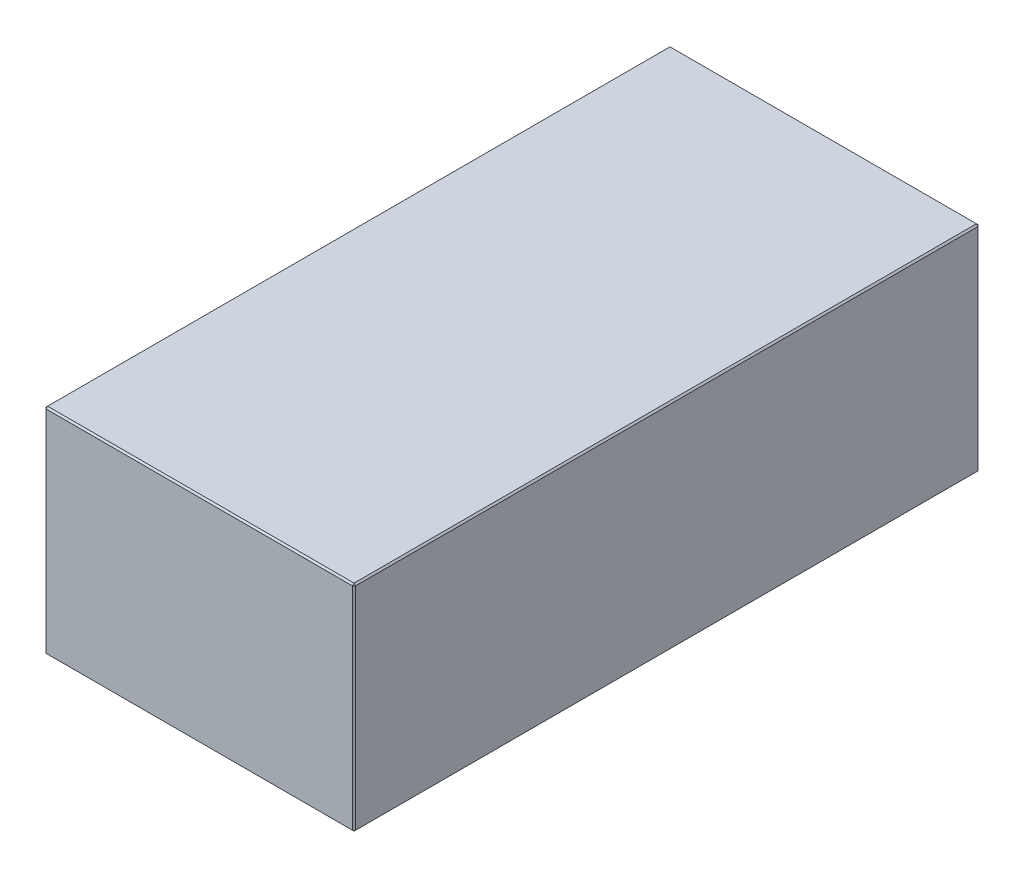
ISO-10303-21;
HEADER;
FILE_DESCRIPTION(('STEP AP214'),'2;1');
FILE_NAME('part.step','',(''),(''),'','','');
FILE_SCHEMA(('AUTOMOTIVE_DESIGN { 1 0 10303 214 1 1 1 1 }'));
ENDSEC;
DATA;
#1=APPLICATION_CONTEXT('core data for automotive mechanical design processes');
#2=APPLICATION_PROTOCOL_DEFINITION('international standard','automotive_design',2000,#1);
#3=PRODUCT_CONTEXT('',#1,'mechanical');
#4=PRODUCT('Part','Part','',(#3));
#5=PRODUCT_RELATED_PRODUCT_CATEGORY('part','',(#4));
#6=PRODUCT_DEFINITION_FORMATION('','',#4);
#7=PRODUCT_DEFINITION_CONTEXT('part definition',#1,'design');
#8=PRODUCT_DEFINITION('design','',#6,#7);
#9=PRODUCT_DEFINITION_SHAPE('','',#8);
#10=(LENGTH_UNIT() NAMED_UNIT(*) SI_UNIT(.MILLI.,.METRE.));
#11=(NAMED_UNIT(*) PLANE_ANGLE_UNIT() SI_UNIT($,.RADIAN.));
#12=(NAMED_UNIT(*) SI_UNIT($,.STERADIAN.) SOLID_ANGLE_UNIT());
#13=UNCERTAINTY_MEASURE_WITH_UNIT(LENGTH_MEASURE(1.E-05),#10,'distance_accuracy_value','');
#14=(GEOMETRIC_REPRESENTATION_CONTEXT(3) GLOBAL_UNCERTAINTY_ASSIGNED_CONTEXT((#13)) GLOBAL_UNIT_ASSIGNED_CONTEXT((#10,
#11,#12)) REPRESENTATION_CONTEXT('',''));
#15=CARTESIAN_POINT('',(0.,0.,0.));
#16=DIRECTION('',(0.,0.,1.));
#17=DIRECTION('',(1.,0.,0.));
#18=AXIS2_PLACEMENT_3D('',#15,#16,#17);
#19=CARTESIAN_POINT('',(-98.,136.,198.));
#20=DIRECTION('',(1.,0.,0.));
#21=DIRECTION('',(0.,0.,-1.));
#22=AXIS2_PLACEMENT_3D('',#19,#20,#21);
#23=PLANE('',#22);
#24=DIRECTION('',(0.,-1.,0.));
#25=VECTOR('',#24,1.);
#26=CARTESIAN_POINT('',(-98.,136.,-197.));
#27=LINE('',#26,#25);
#28=CARTESIAN_POINT('',(-98.,135.,-197.));
#29=VERTEX_POINT('',#28);
#30=CARTESIAN_POINT('',(-98.,1.,-197.));
#31=VERTEX_POINT('',#30);
#32=EDGE_CURVE('E115',#29,#31,#27,.T.);
#33=ORIENTED_EDGE('',*,*,#32,.T.);
#34=DIRECTION('',(0.,0.,1.));
#35=VECTOR('',#34,1.);
#36=CARTESIAN_POINT('',(-98.,1.,198.));
#37=LINE('',#36,#35);
#38=CARTESIAN_POINT('',(-98.,1.,197.));
#39=VERTEX_POINT('',#38);
#40=EDGE_CURVE('E111',#31,#39,#37,.T.);
#41=ORIENTED_EDGE('',*,*,#40,.T.);
#42=DIRECTION('',(0.,1.,0.));
#43=VECTOR('',#42,1.);
#44=CARTESIAN_POINT('',(-98.,136.,197.));
#45=LINE('',#44,#43);
#46=CARTESIAN_POINT('',(-98.,135.,197.));
#47=VERTEX_POINT('',#46);
#48=EDGE_CURVE('E104',#39,#47,#45,.T.);
#49=ORIENTED_EDGE('',*,*,#48,.T.);
#50=DIRECTION('',(0.,0.,-1.));
#51=VECTOR('',#50,1.);
#52=CARTESIAN_POINT('',(-98.,135.,-198.));
#53=LINE('',#52,#51);
#54=EDGE_CURVE('E108',#47,#29,#53,.T.);
#55=ORIENTED_EDGE('',*,*,#54,.T.);
#56=EDGE_LOOP('',(#33,#41,#49,#55));
#57=FACE_BOUND('',#56,.T.);
#58=ADVANCED_FACE('F16',(#57),#23,.F.);
#59=CARTESIAN_POINT('',(98.,136.,198.));
#60=DIRECTION('',(0.,0.,-1.));
#61=DIRECTION('',(-1.,0.,0.));
#62=AXIS2_PLACEMENT_3D('',#59,#60,#61);
#63=PLANE('',#62);
#64=DIRECTION('',(-1.,0.,0.));
#65=VECTOR('',#64,1.);
#66=CARTESIAN_POINT('',(-98.,135.,198.));
#67=LINE('',#66,#65);
#68=CARTESIAN_POINT('',(97.,135.,198.));
#69=VERTEX_POINT('',#68);
#70=CARTESIAN_POINT('',(-97.,135.,198.));
#71=VERTEX_POINT('',#70);
#72=EDGE_CURVE('E165',#69,#71,#67,.T.);
#73=ORIENTED_EDGE('',*,*,#72,.T.);
#74=DIRECTION('',(0.,-1.,0.));
#75=VECTOR('',#74,1.);
#76=CARTESIAN_POINT('',(-97.,136.,198.));
#77=LINE('',#76,#75);
#78=CARTESIAN_POINT('',(-97.,1.,198.));
#79=VERTEX_POINT('',#78);
#80=EDGE_CURVE('E123',#71,#79,#77,.T.);
#81=ORIENTED_EDGE('',*,*,#80,.T.);
#82=DIRECTION('',(1.,0.,0.));
#83=VECTOR('',#82,1.);
#84=CARTESIAN_POINT('',(98.,1.,198.));
#85=LINE('',#84,#83);
#86=CARTESIAN_POINT('',(97.,1.,198.));
#87=VERTEX_POINT('',#86);
#88=EDGE_CURVE('E169',#79,#87,#85,.T.);
#89=ORIENTED_EDGE('',*,*,#88,.T.);
#90=DIRECTION('',(0.,1.,0.));
#91=VECTOR('',#90,1.);
#92=CARTESIAN_POINT('',(97.,136.,198.));
#93=LINE('',#92,#91);
#94=EDGE_CURVE('E167',#87,#69,#93,.T.);
#95=ORIENTED_EDGE('',*,*,#94,.T.);
#96=EDGE_LOOP('',(#73,#81,#89,#95));
#97=FACE_BOUND('',#96,.T.);
#98=ADVANCED_FACE('F276',(#97),#63,.F.);
#99=CARTESIAN_POINT('',(98.,136.,198.));
#100=DIRECTION('',(-1.,0.,0.));
#101=DIRECTION('',(0.,0.,1.));
#102=AXIS2_PLACEMENT_3D('',#99,#100,#101);
#103=PLANE('',#102);
#104=DIRECTION('',(0.,0.,-1.));
#105=VECTOR('',#104,1.);
#106=CARTESIAN_POINT('',(98.,1.,198.));
#107=LINE('',#106,#105);
#108=CARTESIAN_POINT('',(98.,1.,197.));
#109=VERTEX_POINT('',#108);
#110=CARTESIAN_POINT('',(98.,1.,-197.));
#111=VERTEX_POINT('',#110);
#112=EDGE_CURVE('E160',#109,#111,#107,.T.);
#113=ORIENTED_EDGE('',*,*,#112,.T.);
#114=DIRECTION('',(0.,1.,0.));
#115=VECTOR('',#114,1.);
#116=CARTESIAN_POINT('',(98.,136.,-197.));
#117=LINE('',#116,#115);
#118=CARTESIAN_POINT('',(98.,135.,-197.));
#119=VERTEX_POINT('',#118);
#120=EDGE_CURVE('E162',#111,#119,#117,.T.);
#121=ORIENTED_EDGE('',*,*,#120,.T.);
#122=DIRECTION('',(0.,0.,1.));
#123=VECTOR('',#122,1.);
#124=CARTESIAN_POINT('',(98.,135.,198.));
#125=LINE('',#124,#123);
#126=CARTESIAN_POINT('',(98.,135.,197.));
#127=VERTEX_POINT('',#126);
#128=EDGE_CURVE('E156',#119,#127,#125,.T.);
#129=ORIENTED_EDGE('',*,*,#128,.T.);
#130=DIRECTION('',(0.,-1.,0.));
#131=VECTOR('',#130,1.);
#132=CARTESIAN_POINT('',(98.,136.,197.));
#133=LINE('',#132,#131);
#134=EDGE_CURVE('E158',#127,#109,#133,.T.);
#135=ORIENTED_EDGE('',*,*,#134,.T.);
#136=EDGE_LOOP('',(#113,#121,#129,#135));
#137=FACE_BOUND('',#136,.T.);
#138=ADVANCED_FACE('F255',(#137),#103,.F.);
#139=CARTESIAN_POINT('',(98.,136.,-198.));
#140=DIRECTION('',(0.,0.,1.));
#141=DIRECTION('',(1.,0.,0.));
#142=AXIS2_PLACEMENT_3D('',#139,#140,#141);
#143=PLANE('',#142);
#144=DIRECTION('',(0.,-1.,0.));
#145=VECTOR('',#144,1.);
#146=CARTESIAN_POINT('',(97.,136.,-198.));
#147=LINE('',#146,#145);
#148=CARTESIAN_POINT('',(97.,135.,-198.));
#149=VERTEX_POINT('',#148);
#150=CARTESIAN_POINT('',(97.,1.,-198.));
#151=VERTEX_POINT('',#150);
#152=EDGE_CURVE('E149',#149,#151,#147,.T.);
#153=ORIENTED_EDGE('',*,*,#152,.T.);
#154=DIRECTION('',(-1.,0.,0.));
#155=VECTOR('',#154,1.);
#156=CARTESIAN_POINT('',(98.,1.,-198.));
#157=LINE('',#156,#155);
#158=CARTESIAN_POINT('',(-97.,1.,-198.));
#159=VERTEX_POINT('',#158);
#160=EDGE_CURVE('E154',#151,#159,#157,.T.);
#161=ORIENTED_EDGE('',*,*,#160,.T.);
#162=DIRECTION('',(0.,1.,0.));
#163=VECTOR('',#162,1.);
#164=CARTESIAN_POINT('',(-97.,136.,-198.));
#165=LINE('',#164,#163);
#166=CARTESIAN_POINT('',(-97.,135.,-198.));
#167=VERTEX_POINT('',#166);
#168=EDGE_CURVE('E151',#159,#167,#165,.T.);
#169=ORIENTED_EDGE('',*,*,#168,.T.);
#170=DIRECTION('',(1.,0.,0.));
#171=VECTOR('',#170,1.);
#172=CARTESIAN_POINT('',(98.,135.,-198.));
#173=LINE('',#172,#171);
#174=EDGE_CURVE('E147',#167,#149,#173,.T.);
#175=ORIENTED_EDGE('',*,*,#174,.T.);
#176=EDGE_LOOP('',(#153,#161,#169,#175));
#177=FACE_BOUND('',#176,.T.);
#178=ADVANCED_FACE('F285',(#177),#143,.F.);
#179=CARTESIAN_POINT('',(0.,136.,0.));
#180=DIRECTION('',(0.,1.,0.));
#181=DIRECTION('',(0.,0.,1.));
#182=AXIS2_PLACEMENT_3D('',#179,#180,#181);
#183=PLANE('',#182);
#184=DIRECTION('',(0.,0.,-1.));
#185=VECTOR('',#184,1.);
#186=CARTESIAN_POINT('',(97.,136.,-198.));
#187=LINE('',#186,#185);
#188=CARTESIAN_POINT('',(97.,136.,197.));
#189=VERTEX_POINT('',#188);
#190=CARTESIAN_POINT('',(97.,136.,-197.));
#191=VERTEX_POINT('',#190);
#192=EDGE_CURVE('E25',#189,#191,#187,.T.);
#193=ORIENTED_EDGE('',*,*,#192,.T.);
#194=DIRECTION('',(-1.,0.,0.));
#195=VECTOR('',#194,1.);
#196=CARTESIAN_POINT('',(-98.,136.,-197.));
#197=LINE('',#196,#195);
#198=CARTESIAN_POINT('',(-97.,136.,-197.));
#199=VERTEX_POINT('',#198);
#200=EDGE_CURVE('E10',#191,#199,#197,.T.);
#201=ORIENTED_EDGE('',*,*,#200,.T.);
#202=DIRECTION('',(0.,0.,1.));
#203=VECTOR('',#202,1.);
#204=CARTESIAN_POINT('',(-97.,136.,198.));
#205=LINE('',#204,#203);
#206=CARTESIAN_POINT('',(-97.,136.,197.));
#207=VERTEX_POINT('',#206);
#208=EDGE_CURVE('E181',#199,#207,#205,.T.);
#209=ORIENTED_EDGE('',*,*,#208,.T.);
#210=DIRECTION('',(1.,0.,0.));
#211=VECTOR('',#210,1.);
#212=CARTESIAN_POINT('',(98.,136.,197.));
#213=LINE('',#212,#211);
#214=EDGE_CURVE('E36',#207,#189,#213,.T.);
#215=ORIENTED_EDGE('',*,*,#214,.T.);
#216=EDGE_LOOP('',(#193,#201,#209,#215));
#217=FACE_BOUND('',#216,.T.);
#218=ADVANCED_FACE('F351',(#217),#183,.T.);
#219=CARTESIAN_POINT('',(0.,0.,0.));
#220=DIRECTION('',(0.,1.,0.));
#221=DIRECTION('',(0.,0.,1.));
#222=AXIS2_PLACEMENT_3D('',#219,#220,#221);
#223=PLANE('',#222);
#224=DIRECTION('',(0.,0.,1.));
#225=VECTOR('',#224,1.);
#226=CARTESIAN_POINT('',(97.,0.,0.));
#227=LINE('',#226,#225);
#228=CARTESIAN_POINT('',(97.,0.,-197.));
#229=VERTEX_POINT('',#228);
#230=CARTESIAN_POINT('',(97.,0.,197.));
#231=VERTEX_POINT('',#230);
#232=EDGE_CURVE('E172',#229,#231,#227,.T.);
#233=ORIENTED_EDGE('',*,*,#232,.T.);
#234=DIRECTION('',(-1.,0.,0.));
#235=VECTOR('',#234,1.);
#236=CARTESIAN_POINT('',(0.,0.,197.));
#237=LINE('',#236,#235);
#238=CARTESIAN_POINT('',(-97.,0.,197.));
#239=VERTEX_POINT('',#238);
#240=EDGE_CURVE('E178',#231,#239,#237,.T.);
#241=ORIENTED_EDGE('',*,*,#240,.T.);
#242=DIRECTION('',(0.,0.,-1.));
#243=VECTOR('',#242,1.);
#244=CARTESIAN_POINT('',(-97.,0.,0.));
#245=LINE('',#244,#243);
#246=CARTESIAN_POINT('',(-97.,0.,-197.));
#247=VERTEX_POINT('',#246);
#248=EDGE_CURVE('E176',#239,#247,#245,.T.);
#249=ORIENTED_EDGE('',*,*,#248,.T.);
#250=DIRECTION('',(1.,0.,0.));
#251=VECTOR('',#250,1.);
#252=CARTESIAN_POINT('',(0.,0.,-197.));
#253=LINE('',#252,#251);
#254=EDGE_CURVE('E174',#247,#229,#253,.T.);
#255=ORIENTED_EDGE('',*,*,#254,.T.);
#256=EDGE_LOOP('',(#233,#241,#249,#255));
#257=FACE_BOUND('',#256,.T.);
#258=ADVANCED_FACE('F247',(#257),#223,.F.);
#259=CARTESIAN_POINT('',(98.,136.,197.));
#260=DIRECTION('',(-0.707106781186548,0.,-0.707106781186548));
#261=DIRECTION('',(0.,-1.,0.));
#262=AXIS2_PLACEMENT_3D('',#259,#260,#261);
#263=PLANE('',#262);
#264=DIRECTION('',(-0.707106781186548,0.,0.707106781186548));
#265=VECTOR('',#264,1.);
#266=CARTESIAN_POINT('',(97.,135.,198.));
#267=LINE('',#266,#265);
#268=EDGE_CURVE('E20',#69,#127,#267,.F.);
#269=ORIENTED_EDGE('',*,*,#268,.F.);
#270=ORIENTED_EDGE('',*,*,#94,.F.);
#271=DIRECTION('',(0.707106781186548,0.,-0.707106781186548));
#272=VECTOR('',#271,1.);
#273=CARTESIAN_POINT('',(97.,1.,198.));
#274=LINE('',#273,#272);
#275=EDGE_CURVE('E143',#109,#87,#274,.F.);
#276=ORIENTED_EDGE('',*,*,#275,.F.);
#277=ORIENTED_EDGE('',*,*,#134,.F.);
#278=EDGE_LOOP('',(#269,#270,#276,#277));
#279=FACE_BOUND('',#278,.T.);
#280=ADVANCED_FACE('F18',(#279),#263,.F.);
#281=CARTESIAN_POINT('',(97.,135.,198.));
#282=DIRECTION('',(0.577350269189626,0.577350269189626,0.577350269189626));
#283=DIRECTION('',(0.707106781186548,0.,-0.707106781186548));
#284=AXIS2_PLACEMENT_3D('',#281,#282,#283);
#285=PLANE('',#284);
#286=DIRECTION('',(0.,-0.707106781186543,0.707106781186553));
#287=VECTOR('',#286,1.);
#288=CARTESIAN_POINT('',(97.,135.,198.));
#289=LINE('',#288,#287);
#290=EDGE_CURVE('E227',#69,#189,#289,.F.);
#291=ORIENTED_EDGE('',*,*,#290,.F.);
#292=ORIENTED_EDGE('',*,*,#268,.T.);
#293=DIRECTION('',(-0.707106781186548,0.707106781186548,0.));
#294=VECTOR('',#293,1.);
#295=CARTESIAN_POINT('',(97.5,135.5,197.));
#296=LINE('',#295,#294);
#297=EDGE_CURVE('E229',#189,#127,#296,.F.);
#298=ORIENTED_EDGE('',*,*,#297,.F.);
#299=EDGE_LOOP('',(#291,#292,#298));
#300=FACE_BOUND('',#299,.T.);
#301=ADVANCED_FACE('F271',(#300),#285,.T.);
#302=CARTESIAN_POINT('',(97.,1.,198.));
#303=DIRECTION('',(0.57735026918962,-0.577350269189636,0.57735026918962));
#304=DIRECTION('',(0.,-0.707106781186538,-0.707106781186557));
#305=AXIS2_PLACEMENT_3D('',#302,#303,#304);
#306=PLANE('',#305);
#307=DIRECTION('',(-0.707106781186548,-0.707106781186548,0.));
#308=VECTOR('',#307,1.);
#309=CARTESIAN_POINT('',(97.5,0.500000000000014,197.));
#310=LINE('',#309,#308);
#311=EDGE_CURVE('E221',#109,#231,#310,.T.);
#312=ORIENTED_EDGE('',*,*,#311,.F.);
#313=ORIENTED_EDGE('',*,*,#275,.T.);
#314=DIRECTION('',(0.,0.707106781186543,0.707106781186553));
#315=VECTOR('',#314,1.);
#316=CARTESIAN_POINT('',(97.,1.,198.));
#317=LINE('',#316,#315);
#318=EDGE_CURVE('E224',#231,#87,#317,.T.);
#319=ORIENTED_EDGE('',*,*,#318,.F.);
#320=EDGE_LOOP('',(#312,#313,#319));
#321=FACE_BOUND('',#320,.T.);
#322=ADVANCED_FACE('F236',(#321),#306,.T.);
#323=CARTESIAN_POINT('',(97.,136.,0.));
#324=DIRECTION('',(0.707106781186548,0.707106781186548,0.));
#325=DIRECTION('',(0.,0.,1.));
#326=AXIS2_PLACEMENT_3D('',#323,#324,#325);
#327=PLANE('',#326);
#328=ORIENTED_EDGE('',*,*,#297,.T.);
#329=ORIENTED_EDGE('',*,*,#128,.F.);
#330=DIRECTION('',(0.707106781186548,-0.707106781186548,0.));
#331=VECTOR('',#330,1.);
#332=CARTESIAN_POINT('',(98.,135.,-197.));
#333=LINE('',#332,#331);
#334=EDGE_CURVE('E216',#191,#119,#333,.T.);
#335=ORIENTED_EDGE('',*,*,#334,.F.);
#336=ORIENTED_EDGE('',*,*,#192,.F.);
#337=EDGE_LOOP('',(#328,#329,#335,#336));
#338=FACE_BOUND('',#337,.T.);
#339=ADVANCED_FACE('F266',(#338),#327,.T.);
#340=CARTESIAN_POINT('',(0.,136.,197.));
#341=DIRECTION('',(0.,0.707106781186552,0.707106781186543));
#342=DIRECTION('',(-1.,0.,0.));
#343=AXIS2_PLACEMENT_3D('',#340,#341,#342);
#344=PLANE('',#343);
#345=ORIENTED_EDGE('',*,*,#290,.T.);
#346=ORIENTED_EDGE('',*,*,#214,.F.);
#347=DIRECTION('',(0.,0.707106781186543,-0.707106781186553));
#348=VECTOR('',#347,1.);
#349=CARTESIAN_POINT('',(-97.,135.5,197.5));
#350=LINE('',#349,#348);
#351=EDGE_CURVE('E127',#71,#207,#350,.T.);
#352=ORIENTED_EDGE('',*,*,#351,.F.);
#353=ORIENTED_EDGE('',*,*,#72,.F.);
#354=EDGE_LOOP('',(#345,#346,#352,#353));
#355=FACE_BOUND('',#354,.T.);
#356=ADVANCED_FACE('F274',(#355),#344,.T.);
#357=CARTESIAN_POINT('',(-97.,136.,198.));
#358=DIRECTION('',(0.707106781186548,0.,-0.707106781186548));
#359=DIRECTION('',(0.,-1.,0.));
#360=AXIS2_PLACEMENT_3D('',#357,#358,#359);
#361=PLANE('',#360);
#362=DIRECTION('',(0.707106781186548,0.,0.707106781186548));
#363=VECTOR('',#362,1.);
#364=CARTESIAN_POINT('',(-97.,1.,198.));
#365=LINE('',#364,#363);
#366=EDGE_CURVE('E128',#79,#39,#365,.F.);
#367=ORIENTED_EDGE('',*,*,#366,.F.);
#368=ORIENTED_EDGE('',*,*,#80,.F.);
#369=DIRECTION('',(-0.707106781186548,0.,-0.707106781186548));
#370=VECTOR('',#369,1.);
#371=CARTESIAN_POINT('',(-98.,135.,197.));
#372=LINE('',#371,#370);
#373=EDGE_CURVE('E119',#47,#71,#372,.F.);
#374=ORIENTED_EDGE('',*,*,#373,.F.);
#375=ORIENTED_EDGE('',*,*,#48,.F.);
#376=EDGE_LOOP('',(#367,#368,#374,#375));
#377=FACE_BOUND('',#376,.T.);
#378=ADVANCED_FACE('F121',(#377),#361,.F.);
#379=CARTESIAN_POINT('',(98.,1.,198.));
#380=DIRECTION('',(0.,0.707106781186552,-0.707106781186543));
#381=DIRECTION('',(1.,0.,0.));
#382=AXIS2_PLACEMENT_3D('',#379,#380,#381);
#383=PLANE('',#382);
#384=ORIENTED_EDGE('',*,*,#318,.T.);
#385=ORIENTED_EDGE('',*,*,#88,.F.);
#386=DIRECTION('',(0.,-0.707106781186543,-0.707106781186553));
#387=VECTOR('',#386,1.);
#388=CARTESIAN_POINT('',(-97.,1.,198.));
#389=LINE('',#388,#387);
#390=EDGE_CURVE('E212',#239,#79,#389,.F.);
#391=ORIENTED_EDGE('',*,*,#390,.F.);
#392=ORIENTED_EDGE('',*,*,#240,.F.);
#393=EDGE_LOOP('',(#384,#385,#391,#392));
#394=FACE_BOUND('',#393,.T.);
#395=ADVANCED_FACE('F244',(#394),#383,.F.);
#396=CARTESIAN_POINT('',(98.,1.,198.));
#397=DIRECTION('',(-0.707106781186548,0.707106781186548,0.));
#398=DIRECTION('',(0.,0.,-1.));
#399=AXIS2_PLACEMENT_3D('',#396,#397,#398);
#400=PLANE('',#399);
#401=ORIENTED_EDGE('',*,*,#311,.T.);
#402=ORIENTED_EDGE('',*,*,#232,.F.);
#403=DIRECTION('',(0.707106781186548,0.707106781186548,0.));
#404=VECTOR('',#403,1.);
#405=CARTESIAN_POINT('',(97.5,0.500000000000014,-197.));
#406=LINE('',#405,#404);
#407=EDGE_CURVE('E209',#111,#229,#406,.F.);
#408=ORIENTED_EDGE('',*,*,#407,.F.);
#409=ORIENTED_EDGE('',*,*,#112,.F.);
#410=EDGE_LOOP('',(#401,#402,#408,#409));
#411=FACE_BOUND('',#410,.T.);
#412=ADVANCED_FACE('F252',(#411),#400,.F.);
#413=CARTESIAN_POINT('',(97.,136.,-198.));
#414=DIRECTION('',(-0.707106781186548,0.,0.707106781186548));
#415=DIRECTION('',(0.,-1.,0.));
#416=AXIS2_PLACEMENT_3D('',#413,#414,#415);
#417=PLANE('',#416);
#418=DIRECTION('',(0.707106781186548,0.,0.707106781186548));
#419=VECTOR('',#418,1.);
#420=CARTESIAN_POINT('',(98.,135.,-197.));
#421=LINE('',#420,#419);
#422=EDGE_CURVE('E218',#119,#149,#421,.F.);
#423=ORIENTED_EDGE('',*,*,#422,.F.);
#424=ORIENTED_EDGE('',*,*,#120,.F.);
#425=DIRECTION('',(-0.707106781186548,0.,-0.707106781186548));
#426=VECTOR('',#425,1.);
#427=CARTESIAN_POINT('',(97.,1.,-198.));
#428=LINE('',#427,#426);
#429=EDGE_CURVE('E206',#151,#111,#428,.F.);
#430=ORIENTED_EDGE('',*,*,#429,.F.);
#431=ORIENTED_EDGE('',*,*,#152,.F.);
#432=EDGE_LOOP('',(#423,#424,#430,#431));
#433=FACE_BOUND('',#432,.T.);
#434=ADVANCED_FACE('F259',(#433),#417,.F.);
#435=CARTESIAN_POINT('',(98.,135.,-197.));
#436=DIRECTION('',(0.577350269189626,0.577350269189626,-0.577350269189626));
#437=DIRECTION('',(-0.707106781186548,0.,-0.707106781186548));
#438=AXIS2_PLACEMENT_3D('',#435,#436,#437);
#439=PLANE('',#438);
#440=ORIENTED_EDGE('',*,*,#334,.T.);
#441=ORIENTED_EDGE('',*,*,#422,.T.);
#442=DIRECTION('',(0.,0.707106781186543,0.707106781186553));
#443=VECTOR('',#442,1.);
#444=CARTESIAN_POINT('',(97.,135.5,-197.5));
#445=LINE('',#444,#443);
#446=EDGE_CURVE('E135',#191,#149,#445,.F.);
#447=ORIENTED_EDGE('',*,*,#446,.F.);
#448=EDGE_LOOP('',(#440,#441,#447));
#449=FACE_BOUND('',#448,.T.);
#450=ADVANCED_FACE('F326',(#449),#439,.T.);
#451=CARTESIAN_POINT('',(-98.,135.,197.));
#452=DIRECTION('',(-0.577350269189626,0.577350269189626,0.577350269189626));
#453=DIRECTION('',(0.707106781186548,0.,0.707106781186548));
#454=AXIS2_PLACEMENT_3D('',#451,#452,#453);
#455=PLANE('',#454);
#456=ORIENTED_EDGE('',*,*,#373,.T.);
#457=ORIENTED_EDGE('',*,*,#351,.T.);
#458=DIRECTION('',(-0.707106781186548,-0.707106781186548,0.));
#459=VECTOR('',#458,1.);
#460=CARTESIAN_POINT('',(-98.,135.,197.));
#461=LINE('',#460,#459);
#462=EDGE_CURVE('E131',#47,#207,#461,.F.);
#463=ORIENTED_EDGE('',*,*,#462,.F.);
#464=EDGE_LOOP('',(#456,#457,#463));
#465=FACE_BOUND('',#464,.T.);
#466=ADVANCED_FACE('F132',(#465),#455,.T.);
#467=CARTESIAN_POINT('',(-97.,1.,198.));
#468=DIRECTION('',(-0.57735026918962,-0.577350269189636,0.57735026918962));
#469=DIRECTION('',(0.,-0.707106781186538,-0.707106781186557));
#470=AXIS2_PLACEMENT_3D('',#467,#468,#469);
#471=PLANE('',#470);
#472=ORIENTED_EDGE('',*,*,#390,.T.);
#473=ORIENTED_EDGE('',*,*,#366,.T.);
#474=DIRECTION('',(-0.707106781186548,0.707106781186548,0.));
#475=VECTOR('',#474,1.);
#476=CARTESIAN_POINT('',(-97.5,0.500000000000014,197.));
#477=LINE('',#476,#475);
#478=EDGE_CURVE('E136',#239,#39,#477,.T.);
#479=ORIENTED_EDGE('',*,*,#478,.F.);
#480=EDGE_LOOP('',(#472,#473,#479));
#481=FACE_BOUND('',#480,.T.);
#482=ADVANCED_FACE('F319',(#481),#471,.T.);
#483=CARTESIAN_POINT('',(97.,1.,-198.));
#484=DIRECTION('',(0.57735026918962,-0.577350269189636,-0.57735026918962));
#485=DIRECTION('',(0.,0.707106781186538,-0.707106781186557));
#486=AXIS2_PLACEMENT_3D('',#483,#484,#485);
#487=PLANE('',#486);
#488=ORIENTED_EDGE('',*,*,#429,.T.);
#489=ORIENTED_EDGE('',*,*,#407,.T.);
#490=DIRECTION('',(0.,-0.707106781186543,0.707106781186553));
#491=VECTOR('',#490,1.);
#492=CARTESIAN_POINT('',(97.,1.,-198.));
#493=LINE('',#492,#491);
#494=EDGE_CURVE('E199',#151,#229,#493,.T.);
#495=ORIENTED_EDGE('',*,*,#494,.F.);
#496=EDGE_LOOP('',(#488,#489,#495));
#497=FACE_BOUND('',#496,.T.);
#498=ADVANCED_FACE('F315',(#497),#487,.T.);
#499=CARTESIAN_POINT('',(0.,136.,-197.));
#500=DIRECTION('',(0.,0.707106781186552,-0.707106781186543));
#501=DIRECTION('',(1.,0.,0.));
#502=AXIS2_PLACEMENT_3D('',#499,#500,#501);
#503=PLANE('',#502);
#504=ORIENTED_EDGE('',*,*,#446,.T.);
#505=ORIENTED_EDGE('',*,*,#174,.F.);
#506=DIRECTION('',(0.,-0.707106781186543,-0.707106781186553));
#507=VECTOR('',#506,1.);
#508=CARTESIAN_POINT('',(-97.,135.,-198.));
#509=LINE('',#508,#507);
#510=EDGE_CURVE('E196',#199,#167,#509,.T.);
#511=ORIENTED_EDGE('',*,*,#510,.F.);
#512=ORIENTED_EDGE('',*,*,#200,.F.);
#513=EDGE_LOOP('',(#504,#505,#511,#512));
#514=FACE_BOUND('',#513,.T.);
#515=ADVANCED_FACE('F312',(#514),#503,.T.);
#516=CARTESIAN_POINT('',(-97.,136.,0.));
#517=DIRECTION('',(-0.707106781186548,0.707106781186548,0.));
#518=DIRECTION('',(0.,0.,-1.));
#519=AXIS2_PLACEMENT_3D('',#516,#517,#518);
#520=PLANE('',#519);
#521=ORIENTED_EDGE('',*,*,#462,.T.);
#522=ORIENTED_EDGE('',*,*,#208,.F.);
#523=DIRECTION('',(0.707106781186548,0.707106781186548,0.));
#524=VECTOR('',#523,1.);
#525=CARTESIAN_POINT('',(-97.5,135.5,-197.));
#526=LINE('',#525,#524);
#527=EDGE_CURVE('E139',#29,#199,#526,.T.);
#528=ORIENTED_EDGE('',*,*,#527,.F.);
#529=ORIENTED_EDGE('',*,*,#54,.F.);
#530=EDGE_LOOP('',(#521,#522,#528,#529));
#531=FACE_BOUND('',#530,.T.);
#532=ADVANCED_FACE('F138',(#531),#520,.T.);
#533=CARTESIAN_POINT('',(-98.,1.,198.));
#534=DIRECTION('',(0.707106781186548,0.707106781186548,0.));
#535=DIRECTION('',(0.,0.,1.));
#536=AXIS2_PLACEMENT_3D('',#533,#534,#535);
#537=PLANE('',#536);
#538=ORIENTED_EDGE('',*,*,#478,.T.);
#539=ORIENTED_EDGE('',*,*,#40,.F.);
#540=DIRECTION('',(0.707106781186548,-0.707106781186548,0.));
#541=VECTOR('',#540,1.);
#542=CARTESIAN_POINT('',(-98.,1.,-197.));
#543=LINE('',#542,#541);
#544=EDGE_CURVE('E192',#247,#31,#543,.F.);
#545=ORIENTED_EDGE('',*,*,#544,.F.);
#546=ORIENTED_EDGE('',*,*,#248,.F.);
#547=EDGE_LOOP('',(#538,#539,#545,#546));
#548=FACE_BOUND('',#547,.T.);
#549=ADVANCED_FACE('F305',(#548),#537,.F.);
#550=CARTESIAN_POINT('',(98.,1.,-198.));
#551=DIRECTION('',(0.,0.707106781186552,0.707106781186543));
#552=DIRECTION('',(-1.,0.,0.));
#553=AXIS2_PLACEMENT_3D('',#550,#551,#552);
#554=PLANE('',#553);
#555=ORIENTED_EDGE('',*,*,#494,.T.);
#556=ORIENTED_EDGE('',*,*,#254,.F.);
#557=DIRECTION('',(0.,0.707106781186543,-0.707106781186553));
#558=VECTOR('',#557,1.);
#559=CARTESIAN_POINT('',(-97.,0.500000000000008,-197.5));
#560=LINE('',#559,#558);
#561=EDGE_CURVE('E189',#159,#247,#560,.F.);
#562=ORIENTED_EDGE('',*,*,#561,.F.);
#563=ORIENTED_EDGE('',*,*,#160,.F.);
#564=EDGE_LOOP('',(#555,#556,#562,#563));
#565=FACE_BOUND('',#564,.T.);
#566=ADVANCED_FACE('F301',(#565),#554,.F.);
#567=CARTESIAN_POINT('',(-97.,135.,-198.));
#568=DIRECTION('',(-0.577350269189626,0.577350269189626,-0.577350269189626));
#569=DIRECTION('',(-0.707106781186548,0.,0.707106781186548));
#570=AXIS2_PLACEMENT_3D('',#567,#568,#569);
#571=PLANE('',#570);
#572=ORIENTED_EDGE('',*,*,#527,.T.);
#573=ORIENTED_EDGE('',*,*,#510,.T.);
#574=DIRECTION('',(0.707106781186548,0.,-0.707106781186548));
#575=VECTOR('',#574,1.);
#576=CARTESIAN_POINT('',(-97.,135.,-198.));
#577=LINE('',#576,#575);
#578=EDGE_CURVE('E187',#29,#167,#577,.T.);
#579=ORIENTED_EDGE('',*,*,#578,.F.);
#580=EDGE_LOOP('',(#572,#573,#579));
#581=FACE_BOUND('',#580,.T.);
#582=ADVANCED_FACE('F297',(#581),#571,.T.);
#583=CARTESIAN_POINT('',(-98.,1.,-197.));
#584=DIRECTION('',(-0.57735026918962,-0.577350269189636,-0.57735026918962));
#585=DIRECTION('',(0.,0.707106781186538,-0.707106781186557));
#586=AXIS2_PLACEMENT_3D('',#583,#584,#585);
#587=PLANE('',#586);
#588=ORIENTED_EDGE('',*,*,#561,.T.);
#589=ORIENTED_EDGE('',*,*,#544,.T.);
#590=DIRECTION('',(-0.707106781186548,0.,0.707106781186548));
#591=VECTOR('',#590,1.);
#592=CARTESIAN_POINT('',(-98.,1.,-197.));
#593=LINE('',#592,#591);
#594=EDGE_CURVE('E185',#159,#31,#593,.T.);
#595=ORIENTED_EDGE('',*,*,#594,.F.);
#596=EDGE_LOOP('',(#588,#589,#595));
#597=FACE_BOUND('',#596,.T.);
#598=ADVANCED_FACE('F293',(#597),#587,.T.);
#599=CARTESIAN_POINT('',(-98.,136.,-197.));
#600=DIRECTION('',(0.707106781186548,0.,0.707106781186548));
#601=DIRECTION('',(0.,-1.,0.));
#602=AXIS2_PLACEMENT_3D('',#599,#600,#601);
#603=PLANE('',#602);
#604=ORIENTED_EDGE('',*,*,#578,.T.);
#605=ORIENTED_EDGE('',*,*,#168,.F.);
#606=ORIENTED_EDGE('',*,*,#594,.T.);
#607=ORIENTED_EDGE('',*,*,#32,.F.);
#608=EDGE_LOOP('',(#604,#605,#606,#607));
#609=FACE_BOUND('',#608,.T.);
#610=ADVANCED_FACE('F290',(#609),#603,.F.);
#611=CLOSED_SHELL('',(#58,#98,#138,#178,#218,#258,#280,#301,#322,#339,#356,#378,#395,#412,#434,
#450,#466,#482,#498,#515,#532,#549,#566,#582,#598,#610));
#612=MANIFOLD_SOLID_BREP('B1',#611);
#613=ADVANCED_BREP_SHAPE_REPRESENTATION('',(#18,#612),#14);
#614=SHAPE_DEFINITION_REPRESENTATION(#9,#613);
ENDSEC;
END-ISO-10303-21;
